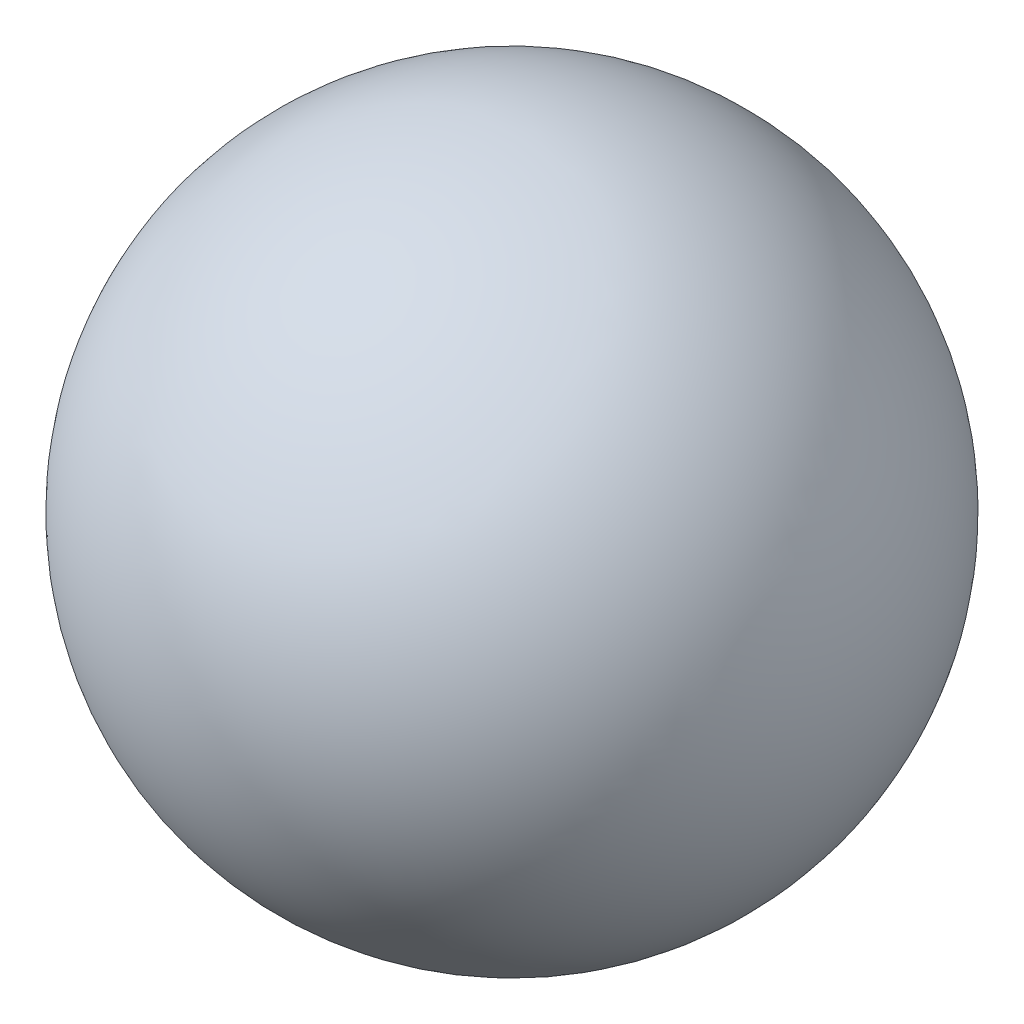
from build123d import *


with BuildPart() as part:
    # Sketch1 → Revolve1 (revolve)
    with BuildSketch(Plane.XY):
        with BuildLine():
            Line((-50, 0), (50, 0))
            ThreePointArc((50, 0), (0, 50), (-50, 0))
        make_face()
    revolve(axis=Axis((-76.863052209, 0, 0), (1, 0, 0)))


solid = part.part
